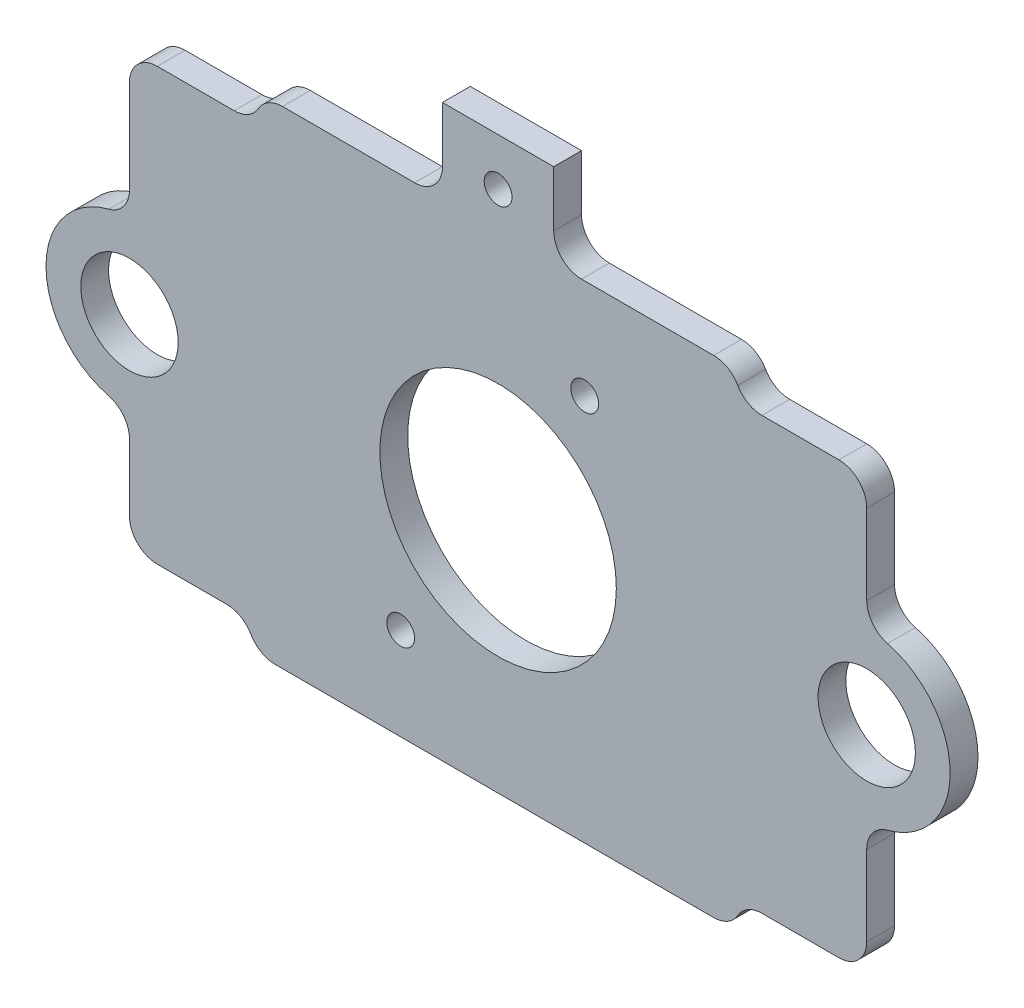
ISO-10303-21;
HEADER;
FILE_DESCRIPTION(('STEP AP214'),'2;1');
FILE_NAME('part.step','',(''),(''),'','','');
FILE_SCHEMA(('AUTOMOTIVE_DESIGN { 1 0 10303 214 1 1 1 1 }'));
ENDSEC;
DATA;
#1=APPLICATION_CONTEXT('core data for automotive mechanical design processes');
#2=APPLICATION_PROTOCOL_DEFINITION('international standard','automotive_design',2000,#1);
#3=PRODUCT_CONTEXT('',#1,'mechanical');
#4=PRODUCT('Part','Part','',(#3));
#5=PRODUCT_RELATED_PRODUCT_CATEGORY('part','',(#4));
#6=PRODUCT_DEFINITION_FORMATION('','',#4);
#7=PRODUCT_DEFINITION_CONTEXT('part definition',#1,'design');
#8=PRODUCT_DEFINITION('design','',#6,#7);
#9=PRODUCT_DEFINITION_SHAPE('','',#8);
#10=(LENGTH_UNIT() NAMED_UNIT(*) SI_UNIT(.MILLI.,.METRE.));
#11=(NAMED_UNIT(*) PLANE_ANGLE_UNIT() SI_UNIT($,.RADIAN.));
#12=(NAMED_UNIT(*) SI_UNIT($,.STERADIAN.) SOLID_ANGLE_UNIT());
#13=UNCERTAINTY_MEASURE_WITH_UNIT(LENGTH_MEASURE(1.E-05),#10,'distance_accuracy_value','');
#14=(GEOMETRIC_REPRESENTATION_CONTEXT(3) GLOBAL_UNCERTAINTY_ASSIGNED_CONTEXT((#13)) GLOBAL_UNIT_ASSIGNED_CONTEXT((#10,
#11,#12)) REPRESENTATION_CONTEXT('',''));
#15=CARTESIAN_POINT('',(0.,0.,0.));
#16=DIRECTION('',(0.,0.,1.));
#17=DIRECTION('',(1.,0.,0.));
#18=AXIS2_PLACEMENT_3D('',#15,#16,#17);
#19=CARTESIAN_POINT('',(26.5,0.49999999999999,2.));
#20=DIRECTION('',(0.,0.,1.));
#21=DIRECTION('',(1.,0.,0.));
#22=AXIS2_PLACEMENT_3D('',#19,#20,#21);
#23=PLANE('',#22);
#24=CARTESIAN_POINT('',(6.225915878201,10.8391868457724,2.));
#25=DIRECTION('',(0.,0.,1.));
#26=DIRECTION('',(1.,0.,0.));
#27=AXIS2_PLACEMENT_3D('',#24,#25,#26);
#28=CIRCLE('',#27,1.);
#29=CARTESIAN_POINT('',(7.225915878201,10.8391868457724,2.));
#30=VERTEX_POINT('',#29);
#31=EDGE_CURVE('E604',#30,#30,#28,.T.);
#32=ORIENTED_EDGE('',*,*,#31,.F.);
#33=EDGE_LOOP('',(#32));
#34=FACE_BOUND('',#33,.T.);
#35=CARTESIAN_POINT('',(26.5,0.49999999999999,2.));
#36=DIRECTION('',(0.,0.,1.));
#37=DIRECTION('',(1.,0.,0.));
#38=AXIS2_PLACEMENT_3D('',#35,#36,#37);
#39=CIRCLE('',#38,3.5);
#40=CARTESIAN_POINT('',(30.,0.49999999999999,2.));
#41=VERTEX_POINT('',#40);
#42=EDGE_CURVE('E592',#41,#41,#39,.T.);
#43=ORIENTED_EDGE('',*,*,#42,.F.);
#44=EDGE_LOOP('',(#43));
#45=FACE_BOUND('',#44,.T.);
#46=CARTESIAN_POINT('',(0.,0.,2.));
#47=DIRECTION('',(0.,0.,1.));
#48=DIRECTION('',(1.,0.,0.));
#49=AXIS2_PLACEMENT_3D('',#46,#47,#48);
#50=CIRCLE('',#49,8.5);
#51=CARTESIAN_POINT('',(8.5,0.,2.));
#52=VERTEX_POINT('',#51);
#53=EDGE_CURVE('E578',#52,#52,#50,.T.);
#54=ORIENTED_EDGE('',*,*,#53,.F.);
#55=EDGE_LOOP('',(#54));
#56=FACE_BOUND('',#55,.T.);
#57=DIRECTION('',(1.,0.,0.));
#58=VECTOR('',#57,1.);
#59=CARTESIAN_POINT('',(-17.5000000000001,-17.,2.));
#60=LINE('',#59,#58);
#61=CARTESIAN_POINT('',(-16.0358983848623,-17.,2.));
#62=VERTEX_POINT('',#61);
#63=CARTESIAN_POINT('',(15.5,-17.,2.));
#64=VERTEX_POINT('',#63);
#65=EDGE_CURVE('E336',#62,#64,#60,.T.);
#66=ORIENTED_EDGE('',*,*,#65,.T.);
#67=CARTESIAN_POINT('',(15.5,-15.,2.));
#68=DIRECTION('',(0.,0.,1.));
#69=DIRECTION('',(1.,0.,0.));
#70=AXIS2_PLACEMENT_3D('',#67,#68,#69);
#71=CIRCLE('',#70,2.);
#72=CARTESIAN_POINT('',(17.2320508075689,-16.,2.));
#73=VERTEX_POINT('',#72);
#74=EDGE_CURVE('E481',#64,#73,#71,.T.);
#75=ORIENTED_EDGE('',*,*,#74,.T.);
#76=CARTESIAN_POINT('',(18.9641016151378,-17.,2.));
#77=DIRECTION('',(0.,0.,1.));
#78=DIRECTION('',(1.,0.,0.));
#79=AXIS2_PLACEMENT_3D('',#76,#77,#78);
#80=CIRCLE('',#79,2.);
#81=CARTESIAN_POINT('',(18.9641016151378,-15.,2.));
#82=VERTEX_POINT('',#81);
#83=EDGE_CURVE('E11',#73,#82,#80,.F.);
#84=ORIENTED_EDGE('',*,*,#83,.T.);
#85=DIRECTION('',(-1.,0.,0.));
#86=VECTOR('',#85,1.);
#87=CARTESIAN_POINT('',(26.5,-15.,2.));
#88=LINE('',#87,#86);
#89=CARTESIAN_POINT('',(24.5,-15.,2.));
#90=VERTEX_POINT('',#89);
#91=EDGE_CURVE('E333',#90,#82,#88,.T.);
#92=ORIENTED_EDGE('',*,*,#91,.F.);
#93=CARTESIAN_POINT('',(24.5,-13.,2.));
#94=DIRECTION('',(0.,0.,1.));
#95=DIRECTION('',(1.,0.,0.));
#96=AXIS2_PLACEMENT_3D('',#93,#94,#95);
#97=CIRCLE('',#96,2.);
#98=CARTESIAN_POINT('',(26.5,-13.,2.));
#99=VERTEX_POINT('',#98);
#100=EDGE_CURVE('E479',#90,#99,#97,.T.);
#101=ORIENTED_EDGE('',*,*,#100,.T.);
#102=DIRECTION('',(0.,-1.,0.));
#103=VECTOR('',#102,1.);
#104=CARTESIAN_POINT('',(26.5,-5.50000000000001,2.));
#105=LINE('',#104,#103);
#106=CARTESIAN_POINT('',(26.5,-7.24596669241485,2.));
#107=VERTEX_POINT('',#106);
#108=EDGE_CURVE('E330',#107,#99,#105,.T.);
#109=ORIENTED_EDGE('',*,*,#108,.F.);
#110=CARTESIAN_POINT('',(28.5,-7.24596669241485,2.));
#111=DIRECTION('',(0.,0.,1.));
#112=DIRECTION('',(1.,0.,0.));
#113=AXIS2_PLACEMENT_3D('',#110,#111,#112);
#114=CIRCLE('',#113,2.);
#115=CARTESIAN_POINT('',(28.,-5.30947501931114,2.));
#116=VERTEX_POINT('',#115);
#117=EDGE_CURVE('E495',#107,#116,#114,.F.);
#118=ORIENTED_EDGE('',*,*,#117,.T.);
#119=CARTESIAN_POINT('',(26.5,0.49999999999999,2.));
#120=DIRECTION('',(0.,0.,1.));
#121=DIRECTION('',(1.,0.,0.));
#122=AXIS2_PLACEMENT_3D('',#119,#120,#121);
#123=CIRCLE('',#122,6.);
#124=CARTESIAN_POINT('',(28.,6.30947501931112,2.));
#125=VERTEX_POINT('',#124);
#126=EDGE_CURVE('E328',#116,#125,#123,.T.);
#127=ORIENTED_EDGE('',*,*,#126,.T.);
#128=CARTESIAN_POINT('',(28.5,8.24596669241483,2.));
#129=DIRECTION('',(0.,0.,1.));
#130=DIRECTION('',(1.,0.,0.));
#131=AXIS2_PLACEMENT_3D('',#128,#129,#130);
#132=CIRCLE('',#131,2.);
#133=CARTESIAN_POINT('',(26.5,8.24596669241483,2.));
#134=VERTEX_POINT('',#133);
#135=EDGE_CURVE('E386',#125,#134,#132,.F.);
#136=ORIENTED_EDGE('',*,*,#135,.T.);
#137=DIRECTION('',(0.,-1.,0.));
#138=VECTOR('',#137,1.);
#139=CARTESIAN_POINT('',(26.5,16.,2.));
#140=LINE('',#139,#138);
#141=CARTESIAN_POINT('',(26.5,14.,2.));
#142=VERTEX_POINT('',#141);
#143=EDGE_CURVE('E325',#142,#134,#140,.T.);
#144=ORIENTED_EDGE('',*,*,#143,.F.);
#145=CARTESIAN_POINT('',(24.5,14.,2.));
#146=DIRECTION('',(0.,0.,1.));
#147=DIRECTION('',(1.,0.,0.));
#148=AXIS2_PLACEMENT_3D('',#145,#146,#147);
#149=CIRCLE('',#148,2.);
#150=CARTESIAN_POINT('',(24.5,16.,2.));
#151=VERTEX_POINT('',#150);
#152=EDGE_CURVE('E364',#142,#151,#149,.T.);
#153=ORIENTED_EDGE('',*,*,#152,.T.);
#154=DIRECTION('',(-1.,0.,0.));
#155=VECTOR('',#154,1.);
#156=CARTESIAN_POINT('',(26.5,16.,2.));
#157=LINE('',#156,#155);
#158=CARTESIAN_POINT('',(18.9641016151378,16.,2.));
#159=VERTEX_POINT('',#158);
#160=EDGE_CURVE('E322',#151,#159,#157,.T.);
#161=ORIENTED_EDGE('',*,*,#160,.T.);
#162=CARTESIAN_POINT('',(18.9641016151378,18.,2.));
#163=DIRECTION('',(0.,0.,1.));
#164=DIRECTION('',(1.,0.,0.));
#165=AXIS2_PLACEMENT_3D('',#162,#163,#164);
#166=CIRCLE('',#165,2.);
#167=CARTESIAN_POINT('',(17.232050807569,17.,2.));
#168=VERTEX_POINT('',#167);
#169=EDGE_CURVE('E395',#159,#168,#166,.F.);
#170=ORIENTED_EDGE('',*,*,#169,.T.);
#171=CARTESIAN_POINT('',(15.5000000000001,16.0000000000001,2.));
#172=DIRECTION('',(0.,0.,1.));
#173=DIRECTION('',(1.,0.,0.));
#174=AXIS2_PLACEMENT_3D('',#171,#172,#173);
#175=CIRCLE('',#174,2.);
#176=CARTESIAN_POINT('',(15.5000000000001,18.0000000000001,2.));
#177=VERTEX_POINT('',#176);
#178=EDGE_CURVE('E366',#168,#177,#175,.T.);
#179=ORIENTED_EDGE('',*,*,#178,.T.);
#180=DIRECTION('',(1.,0.,0.));
#181=VECTOR('',#180,1.);
#182=CARTESIAN_POINT('',(4.,18.,2.));
#183=LINE('',#182,#181);
#184=CARTESIAN_POINT('',(6.00000000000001,18.,2.));
#185=VERTEX_POINT('',#184);
#186=EDGE_CURVE('E319',#185,#177,#183,.T.);
#187=ORIENTED_EDGE('',*,*,#186,.F.);
#188=CARTESIAN_POINT('',(6.,20.,2.));
#189=DIRECTION('',(0.,0.,1.));
#190=DIRECTION('',(1.,0.,0.));
#191=AXIS2_PLACEMENT_3D('',#188,#189,#190);
#192=CIRCLE('',#191,2.);
#193=CARTESIAN_POINT('',(4.,20.,2.));
#194=VERTEX_POINT('',#193);
#195=EDGE_CURVE('E381',#185,#194,#192,.F.);
#196=ORIENTED_EDGE('',*,*,#195,.T.);
#197=DIRECTION('',(0.,-1.,0.));
#198=VECTOR('',#197,1.);
#199=CARTESIAN_POINT('',(4.,24.,2.));
#200=LINE('',#199,#198);
#201=CARTESIAN_POINT('',(4.,24.,2.));
#202=VERTEX_POINT('',#201);
#203=EDGE_CURVE('E316',#202,#194,#200,.T.);
#204=ORIENTED_EDGE('',*,*,#203,.F.);
#205=DIRECTION('',(1.,0.,0.));
#206=VECTOR('',#205,1.);
#207=CARTESIAN_POINT('',(-4.,24.,2.));
#208=LINE('',#207,#206);
#209=CARTESIAN_POINT('',(-4.,24.,2.));
#210=VERTEX_POINT('',#209);
#211=EDGE_CURVE('E314',#210,#202,#208,.T.);
#212=ORIENTED_EDGE('',*,*,#211,.F.);
#213=DIRECTION('',(0.,1.,0.));
#214=VECTOR('',#213,1.);
#215=CARTESIAN_POINT('',(-4.,18.,2.));
#216=LINE('',#215,#214);
#217=CARTESIAN_POINT('',(-4.,20.,2.));
#218=VERTEX_POINT('',#217);
#219=EDGE_CURVE('E263',#218,#210,#216,.T.);
#220=ORIENTED_EDGE('',*,*,#219,.F.);
#221=CARTESIAN_POINT('',(-6.,20.,2.));
#222=DIRECTION('',(0.,0.,1.));
#223=DIRECTION('',(1.,0.,0.));
#224=AXIS2_PLACEMENT_3D('',#221,#222,#223);
#225=CIRCLE('',#224,2.);
#226=CARTESIAN_POINT('',(-6.,18.,2.));
#227=VERTEX_POINT('',#226);
#228=EDGE_CURVE('E419',#218,#227,#225,.F.);
#229=ORIENTED_EDGE('',*,*,#228,.T.);
#230=DIRECTION('',(1.,0.,0.));
#231=VECTOR('',#230,1.);
#232=CARTESIAN_POINT('',(-17.5000000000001,18.,2.));
#233=LINE('',#232,#231);
#234=CARTESIAN_POINT('',(-15.5000000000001,18.,2.));
#235=VERTEX_POINT('',#234);
#236=EDGE_CURVE('E310',#235,#227,#233,.T.);
#237=ORIENTED_EDGE('',*,*,#236,.F.);
#238=CARTESIAN_POINT('',(-15.5000000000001,16.,2.));
#239=DIRECTION('',(0.,0.,1.));
#240=DIRECTION('',(1.,0.,0.));
#241=AXIS2_PLACEMENT_3D('',#238,#239,#240);
#242=CIRCLE('',#241,2.);
#243=CARTESIAN_POINT('',(-17.2320508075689,17.,2.));
#244=VERTEX_POINT('',#243);
#245=EDGE_CURVE('E410',#235,#244,#242,.T.);
#246=ORIENTED_EDGE('',*,*,#245,.T.);
#247=CARTESIAN_POINT('',(-18.9641016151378,18.,2.));
#248=DIRECTION('',(0.,0.,1.));
#249=DIRECTION('',(1.,0.,0.));
#250=AXIS2_PLACEMENT_3D('',#247,#248,#249);
#251=CIRCLE('',#250,2.);
#252=CARTESIAN_POINT('',(-18.9641016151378,16.,2.));
#253=VERTEX_POINT('',#252);
#254=EDGE_CURVE('E428',#244,#253,#251,.F.);
#255=ORIENTED_EDGE('',*,*,#254,.T.);
#256=DIRECTION('',(1.,0.,0.));
#257=VECTOR('',#256,1.);
#258=CARTESIAN_POINT('',(-26.5,16.,2.));
#259=LINE('',#258,#257);
#260=CARTESIAN_POINT('',(-24.5,16.,2.));
#261=VERTEX_POINT('',#260);
#262=EDGE_CURVE('E307',#261,#253,#259,.T.);
#263=ORIENTED_EDGE('',*,*,#262,.F.);
#264=CARTESIAN_POINT('',(-24.5,14.,2.));
#265=DIRECTION('',(0.,0.,1.));
#266=DIRECTION('',(1.,0.,0.));
#267=AXIS2_PLACEMENT_3D('',#264,#265,#266);
#268=CIRCLE('',#267,2.);
#269=CARTESIAN_POINT('',(-26.5,14.,2.));
#270=VERTEX_POINT('',#269);
#271=EDGE_CURVE('E408',#261,#270,#268,.T.);
#272=ORIENTED_EDGE('',*,*,#271,.T.);
#273=DIRECTION('',(0.,-1.,0.));
#274=VECTOR('',#273,1.);
#275=CARTESIAN_POINT('',(-26.5,16.,2.));
#276=LINE('',#275,#274);
#277=CARTESIAN_POINT('',(-26.5,7.29596669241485,2.));
#278=VERTEX_POINT('',#277);
#279=EDGE_CURVE('E268',#270,#278,#276,.T.);
#280=ORIENTED_EDGE('',*,*,#279,.T.);
#281=CARTESIAN_POINT('',(-28.5,7.29596669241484,2.));
#282=DIRECTION('',(0.,0.,1.));
#283=DIRECTION('',(1.,0.,0.));
#284=AXIS2_PLACEMENT_3D('',#281,#282,#283);
#285=CIRCLE('',#284,2.);
#286=CARTESIAN_POINT('',(-28.,5.35947501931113,2.));
#287=VERTEX_POINT('',#286);
#288=EDGE_CURVE('E437',#278,#287,#285,.F.);
#289=ORIENTED_EDGE('',*,*,#288,.T.);
#290=CARTESIAN_POINT('',(-26.5,-0.449999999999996,2.));
#291=DIRECTION('',(0.,0.,1.));
#292=DIRECTION('',(1.,0.,0.));
#293=AXIS2_PLACEMENT_3D('',#290,#291,#292);
#294=CIRCLE('',#293,6.);
#295=CARTESIAN_POINT('',(-28.,-6.25947501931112,2.));
#296=VERTEX_POINT('',#295);
#297=EDGE_CURVE('E345',#287,#296,#294,.T.);
#298=ORIENTED_EDGE('',*,*,#297,.T.);
#299=CARTESIAN_POINT('',(-28.5,-8.19596669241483,2.));
#300=DIRECTION('',(0.,0.,1.));
#301=DIRECTION('',(1.,0.,0.));
#302=AXIS2_PLACEMENT_3D('',#299,#300,#301);
#303=CIRCLE('',#302,2.);
#304=CARTESIAN_POINT('',(-26.5,-8.19596669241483,2.));
#305=VERTEX_POINT('',#304);
#306=EDGE_CURVE('E462',#296,#305,#303,.F.);
#307=ORIENTED_EDGE('',*,*,#306,.T.);
#308=DIRECTION('',(0.,-1.,0.));
#309=VECTOR('',#308,1.);
#310=CARTESIAN_POINT('',(-26.5,-6.44999999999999,2.));
#311=LINE('',#310,#309);
#312=CARTESIAN_POINT('',(-26.5,-13.,2.));
#313=VERTEX_POINT('',#312);
#314=EDGE_CURVE('E342',#305,#313,#311,.T.);
#315=ORIENTED_EDGE('',*,*,#314,.T.);
#316=CARTESIAN_POINT('',(-24.5,-13.,2.));
#317=DIRECTION('',(0.,0.,1.));
#318=DIRECTION('',(1.,0.,0.));
#319=AXIS2_PLACEMENT_3D('',#316,#317,#318);
#320=CIRCLE('',#319,2.);
#321=CARTESIAN_POINT('',(-24.5,-15.,2.));
#322=VERTEX_POINT('',#321);
#323=EDGE_CURVE('E451',#313,#322,#320,.T.);
#324=ORIENTED_EDGE('',*,*,#323,.T.);
#325=DIRECTION('',(1.,0.,0.));
#326=VECTOR('',#325,1.);
#327=CARTESIAN_POINT('',(-26.5,-15.,2.));
#328=LINE('',#327,#326);
#329=CARTESIAN_POINT('',(-19.5000000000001,-15.,2.));
#330=VERTEX_POINT('',#329);
#331=EDGE_CURVE('E339',#322,#330,#328,.T.);
#332=ORIENTED_EDGE('',*,*,#331,.T.);
#333=CARTESIAN_POINT('',(-19.5000000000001,-17.,2.));
#334=DIRECTION('',(0.,0.,1.));
#335=DIRECTION('',(1.,0.,0.));
#336=AXIS2_PLACEMENT_3D('',#333,#334,#335);
#337=CIRCLE('',#336,2.);
#338=CARTESIAN_POINT('',(-17.7679491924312,-16.,2.));
#339=VERTEX_POINT('',#338);
#340=EDGE_CURVE('E457',#330,#339,#337,.F.);
#341=ORIENTED_EDGE('',*,*,#340,.T.);
#342=CARTESIAN_POINT('',(-16.0358983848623,-15.,2.));
#343=DIRECTION('',(0.,0.,1.));
#344=DIRECTION('',(1.,0.,0.));
#345=AXIS2_PLACEMENT_3D('',#342,#343,#344);
#346=CIRCLE('',#345,2.);
#347=EDGE_CURVE('E471',#339,#62,#346,.T.);
#348=ORIENTED_EDGE('',*,*,#347,.T.);
#349=EDGE_LOOP('',(#66,#75,#84,#92,#101,#109,#118,#127,#136,#144,#153,#161,#170,#179,#187,#196,
#204,#212,#220,#229,#237,#246,#255,#263,#272,#280,#289,#298,#307,#315,#324,#332,#341,#348));
#350=FACE_BOUND('',#349,.T.);
#351=CARTESIAN_POINT('',(-26.5,-0.449999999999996,2.));
#352=DIRECTION('',(0.,0.,1.));
#353=DIRECTION('',(1.,0.,0.));
#354=AXIS2_PLACEMENT_3D('',#351,#352,#353);
#355=CIRCLE('',#354,3.5);
#356=CARTESIAN_POINT('',(-23.,-0.449999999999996,2.));
#357=VERTEX_POINT('',#356);
#358=EDGE_CURVE('E586',#357,#357,#355,.T.);
#359=ORIENTED_EDGE('',*,*,#358,.F.);
#360=EDGE_LOOP('',(#359));
#361=FACE_BOUND('',#360,.T.);
#362=CARTESIAN_POINT('',(0.,20.6,2.));
#363=DIRECTION('',(0.,0.,1.));
#364=DIRECTION('',(1.,0.,0.));
#365=AXIS2_PLACEMENT_3D('',#362,#363,#364);
#366=CIRCLE('',#365,1.);
#367=CARTESIAN_POINT('',(1.,20.6,2.));
#368=VERTEX_POINT('',#367);
#369=EDGE_CURVE('E598',#368,#368,#366,.T.);
#370=ORIENTED_EDGE('',*,*,#369,.F.);
#371=EDGE_LOOP('',(#370));
#372=FACE_BOUND('',#371,.T.);
#373=CARTESIAN_POINT('',(-7.00129093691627,-10.3552848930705,2.));
#374=DIRECTION('',(0.,0.,1.));
#375=DIRECTION('',(1.,0.,0.));
#376=AXIS2_PLACEMENT_3D('',#373,#374,#375);
#377=CIRCLE('',#376,1.);
#378=CARTESIAN_POINT('',(-6.00129093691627,-10.3552848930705,2.));
#379=VERTEX_POINT('',#378);
#380=EDGE_CURVE('E610',#379,#379,#377,.T.);
#381=ORIENTED_EDGE('',*,*,#380,.F.);
#382=EDGE_LOOP('',(#381));
#383=FACE_BOUND('',#382,.T.);
#384=ADVANCED_FACE('F26',(#34,#45,#56,#350,#361,#372,#383),#23,.T.);
#385=CARTESIAN_POINT('',(26.5,0.49999999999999,0.));
#386=DIRECTION('',(0.,0.,1.));
#387=DIRECTION('',(1.,0.,0.));
#388=AXIS2_PLACEMENT_3D('',#385,#386,#387);
#389=PLANE('',#388);
#390=CARTESIAN_POINT('',(6.225915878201,10.8391868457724,0.));
#391=DIRECTION('',(0.,0.,1.));
#392=DIRECTION('',(1.,0.,0.));
#393=AXIS2_PLACEMENT_3D('',#390,#391,#392);
#394=CIRCLE('',#393,1.);
#395=CARTESIAN_POINT('',(7.225915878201,10.8391868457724,0.));
#396=VERTEX_POINT('',#395);
#397=EDGE_CURVE('E607',#396,#396,#394,.T.);
#398=ORIENTED_EDGE('',*,*,#397,.T.);
#399=EDGE_LOOP('',(#398));
#400=FACE_BOUND('',#399,.T.);
#401=CARTESIAN_POINT('',(26.5,0.49999999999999,0.));
#402=DIRECTION('',(0.,0.,1.));
#403=DIRECTION('',(1.,0.,0.));
#404=AXIS2_PLACEMENT_3D('',#401,#402,#403);
#405=CIRCLE('',#404,3.5);
#406=CARTESIAN_POINT('',(30.,0.49999999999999,0.));
#407=VERTEX_POINT('',#406);
#408=EDGE_CURVE('E595',#407,#407,#405,.T.);
#409=ORIENTED_EDGE('',*,*,#408,.T.);
#410=EDGE_LOOP('',(#409));
#411=FACE_BOUND('',#410,.T.);
#412=CARTESIAN_POINT('',(0.,0.,0.));
#413=DIRECTION('',(0.,0.,1.));
#414=DIRECTION('',(1.,0.,0.));
#415=AXIS2_PLACEMENT_3D('',#412,#413,#414);
#416=CIRCLE('',#415,8.5);
#417=CARTESIAN_POINT('',(8.5,0.,0.));
#418=VERTEX_POINT('',#417);
#419=EDGE_CURVE('E583',#418,#418,#416,.T.);
#420=ORIENTED_EDGE('',*,*,#419,.T.);
#421=EDGE_LOOP('',(#420));
#422=FACE_BOUND('',#421,.T.);
#423=DIRECTION('',(-1.,0.,0.));
#424=VECTOR('',#423,1.);
#425=CARTESIAN_POINT('',(26.5,-15.,0.));
#426=LINE('',#425,#424);
#427=CARTESIAN_POINT('',(24.5,-15.,0.));
#428=VERTEX_POINT('',#427);
#429=CARTESIAN_POINT('',(18.9641016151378,-15.,0.));
#430=VERTEX_POINT('',#429);
#431=EDGE_CURVE('E290',#428,#430,#426,.T.);
#432=ORIENTED_EDGE('',*,*,#431,.T.);
#433=CARTESIAN_POINT('',(18.9641016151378,-17.,0.));
#434=DIRECTION('',(0.,0.,1.));
#435=DIRECTION('',(1.,0.,0.));
#436=AXIS2_PLACEMENT_3D('',#433,#434,#435);
#437=CIRCLE('',#436,2.);
#438=CARTESIAN_POINT('',(17.2320508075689,-16.,0.));
#439=VERTEX_POINT('',#438);
#440=EDGE_CURVE('E34',#430,#439,#437,.T.);
#441=ORIENTED_EDGE('',*,*,#440,.T.);
#442=CARTESIAN_POINT('',(15.5,-15.,0.));
#443=DIRECTION('',(0.,0.,1.));
#444=DIRECTION('',(1.,0.,0.));
#445=AXIS2_PLACEMENT_3D('',#442,#443,#444);
#446=CIRCLE('',#445,2.);
#447=CARTESIAN_POINT('',(15.5,-17.,0.));
#448=VERTEX_POINT('',#447);
#449=EDGE_CURVE('E475',#439,#448,#446,.F.);
#450=ORIENTED_EDGE('',*,*,#449,.T.);
#451=DIRECTION('',(1.,0.,0.));
#452=VECTOR('',#451,1.);
#453=CARTESIAN_POINT('',(-17.5000000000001,-17.,0.));
#454=LINE('',#453,#452);
#455=CARTESIAN_POINT('',(-16.0358983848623,-17.,0.));
#456=VERTEX_POINT('',#455);
#457=EDGE_CURVE('E292',#456,#448,#454,.T.);
#458=ORIENTED_EDGE('',*,*,#457,.F.);
#459=CARTESIAN_POINT('',(-16.0358983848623,-15.,0.));
#460=DIRECTION('',(0.,0.,1.));
#461=DIRECTION('',(1.,0.,0.));
#462=AXIS2_PLACEMENT_3D('',#459,#460,#461);
#463=CIRCLE('',#462,2.);
#464=CARTESIAN_POINT('',(-17.7679491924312,-16.,0.));
#465=VERTEX_POINT('',#464);
#466=EDGE_CURVE('E467',#456,#465,#463,.F.);
#467=ORIENTED_EDGE('',*,*,#466,.T.);
#468=CARTESIAN_POINT('',(-19.5000000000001,-17.,0.));
#469=DIRECTION('',(0.,0.,1.));
#470=DIRECTION('',(1.,0.,0.));
#471=AXIS2_PLACEMENT_3D('',#468,#469,#470);
#472=CIRCLE('',#471,2.);
#473=CARTESIAN_POINT('',(-19.5000000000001,-15.,0.));
#474=VERTEX_POINT('',#473);
#475=EDGE_CURVE('E455',#465,#474,#472,.T.);
#476=ORIENTED_EDGE('',*,*,#475,.T.);
#477=DIRECTION('',(1.,0.,0.));
#478=VECTOR('',#477,1.);
#479=CARTESIAN_POINT('',(-26.5,-15.,0.));
#480=LINE('',#479,#478);
#481=CARTESIAN_POINT('',(-24.5,-15.,0.));
#482=VERTEX_POINT('',#481);
#483=EDGE_CURVE('E295',#482,#474,#480,.T.);
#484=ORIENTED_EDGE('',*,*,#483,.F.);
#485=CARTESIAN_POINT('',(-24.5,-13.,0.));
#486=DIRECTION('',(0.,0.,1.));
#487=DIRECTION('',(1.,0.,0.));
#488=AXIS2_PLACEMENT_3D('',#485,#486,#487);
#489=CIRCLE('',#488,2.);
#490=CARTESIAN_POINT('',(-26.5,-13.,0.));
#491=VERTEX_POINT('',#490);
#492=EDGE_CURVE('E444',#482,#491,#489,.F.);
#493=ORIENTED_EDGE('',*,*,#492,.T.);
#494=DIRECTION('',(0.,-1.,0.));
#495=VECTOR('',#494,1.);
#496=CARTESIAN_POINT('',(-26.5,-6.44999999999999,0.));
#497=LINE('',#496,#495);
#498=CARTESIAN_POINT('',(-26.5,-8.19596669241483,0.));
#499=VERTEX_POINT('',#498);
#500=EDGE_CURVE('E298',#499,#491,#497,.T.);
#501=ORIENTED_EDGE('',*,*,#500,.F.);
#502=CARTESIAN_POINT('',(-28.5,-8.19596669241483,0.));
#503=DIRECTION('',(0.,0.,1.));
#504=DIRECTION('',(1.,0.,0.));
#505=AXIS2_PLACEMENT_3D('',#502,#503,#504);
#506=CIRCLE('',#505,2.);
#507=CARTESIAN_POINT('',(-28.,-6.25947501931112,0.));
#508=VERTEX_POINT('',#507);
#509=EDGE_CURVE('E460',#499,#508,#506,.T.);
#510=ORIENTED_EDGE('',*,*,#509,.T.);
#511=CARTESIAN_POINT('',(-26.5,-0.449999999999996,0.));
#512=DIRECTION('',(0.,0.,1.));
#513=DIRECTION('',(1.,0.,0.));
#514=AXIS2_PLACEMENT_3D('',#511,#512,#513);
#515=CIRCLE('',#514,6.);
#516=CARTESIAN_POINT('',(-28.,5.35947501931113,0.));
#517=VERTEX_POINT('',#516);
#518=EDGE_CURVE('E301',#517,#508,#515,.T.);
#519=ORIENTED_EDGE('',*,*,#518,.F.);
#520=CARTESIAN_POINT('',(-28.5,7.29596669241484,0.));
#521=DIRECTION('',(0.,0.,1.));
#522=DIRECTION('',(1.,0.,0.));
#523=AXIS2_PLACEMENT_3D('',#520,#521,#522);
#524=CIRCLE('',#523,2.);
#525=CARTESIAN_POINT('',(-26.5,7.29596669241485,0.));
#526=VERTEX_POINT('',#525);
#527=EDGE_CURVE('E435',#517,#526,#524,.T.);
#528=ORIENTED_EDGE('',*,*,#527,.T.);
#529=DIRECTION('',(0.,-1.,0.));
#530=VECTOR('',#529,1.);
#531=CARTESIAN_POINT('',(-26.5,16.,0.));
#532=LINE('',#531,#530);
#533=CARTESIAN_POINT('',(-26.5,14.,0.));
#534=VERTEX_POINT('',#533);
#535=EDGE_CURVE('E304',#534,#526,#532,.T.);
#536=ORIENTED_EDGE('',*,*,#535,.F.);
#537=CARTESIAN_POINT('',(-24.5,14.,0.));
#538=DIRECTION('',(0.,0.,1.));
#539=DIRECTION('',(1.,0.,0.));
#540=AXIS2_PLACEMENT_3D('',#537,#538,#539);
#541=CIRCLE('',#540,2.);
#542=CARTESIAN_POINT('',(-24.5,16.,0.));
#543=VERTEX_POINT('',#542);
#544=EDGE_CURVE('E404',#534,#543,#541,.F.);
#545=ORIENTED_EDGE('',*,*,#544,.T.);
#546=DIRECTION('',(1.,0.,0.));
#547=VECTOR('',#546,1.);
#548=CARTESIAN_POINT('',(-26.5,16.,0.));
#549=LINE('',#548,#547);
#550=CARTESIAN_POINT('',(-18.9641016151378,16.,0.));
#551=VERTEX_POINT('',#550);
#552=EDGE_CURVE('E576',#543,#551,#549,.T.);
#553=ORIENTED_EDGE('',*,*,#552,.T.);
#554=CARTESIAN_POINT('',(-18.9641016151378,18.,0.));
#555=DIRECTION('',(0.,0.,1.));
#556=DIRECTION('',(1.,0.,0.));
#557=AXIS2_PLACEMENT_3D('',#554,#555,#556);
#558=CIRCLE('',#557,2.);
#559=CARTESIAN_POINT('',(-17.2320508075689,17.,0.));
#560=VERTEX_POINT('',#559);
#561=EDGE_CURVE('E426',#551,#560,#558,.T.);
#562=ORIENTED_EDGE('',*,*,#561,.T.);
#563=CARTESIAN_POINT('',(-15.5000000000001,16.,0.));
#564=DIRECTION('',(0.,0.,1.));
#565=DIRECTION('',(1.,0.,0.));
#566=AXIS2_PLACEMENT_3D('',#563,#564,#565);
#567=CIRCLE('',#566,2.);
#568=CARTESIAN_POINT('',(-15.5000000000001,18.,0.));
#569=VERTEX_POINT('',#568);
#570=EDGE_CURVE('E406',#560,#569,#567,.F.);
#571=ORIENTED_EDGE('',*,*,#570,.T.);
#572=DIRECTION('',(1.,0.,0.));
#573=VECTOR('',#572,1.);
#574=CARTESIAN_POINT('',(-17.5000000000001,18.,0.));
#575=LINE('',#574,#573);
#576=CARTESIAN_POINT('',(-6.,18.,0.));
#577=VERTEX_POINT('',#576);
#578=EDGE_CURVE('E257',#569,#577,#575,.T.);
#579=ORIENTED_EDGE('',*,*,#578,.T.);
#580=CARTESIAN_POINT('',(-6.,20.,0.));
#581=DIRECTION('',(0.,0.,1.));
#582=DIRECTION('',(1.,0.,0.));
#583=AXIS2_PLACEMENT_3D('',#580,#581,#582);
#584=CIRCLE('',#583,2.);
#585=CARTESIAN_POINT('',(-4.,20.,0.));
#586=VERTEX_POINT('',#585);
#587=EDGE_CURVE('E254',#577,#586,#584,.T.);
#588=ORIENTED_EDGE('',*,*,#587,.T.);
#589=DIRECTION('',(0.,1.,0.));
#590=VECTOR('',#589,1.);
#591=CARTESIAN_POINT('',(-4.,18.,0.));
#592=LINE('',#591,#590);
#593=CARTESIAN_POINT('',(-4.,24.,0.));
#594=VERTEX_POINT('',#593);
#595=EDGE_CURVE('E245',#586,#594,#592,.T.);
#596=ORIENTED_EDGE('',*,*,#595,.T.);
#597=DIRECTION('',(1.,0.,0.));
#598=VECTOR('',#597,1.);
#599=CARTESIAN_POINT('',(-4.,24.,0.));
#600=LINE('',#599,#598);
#601=CARTESIAN_POINT('',(4.,24.,0.));
#602=VERTEX_POINT('',#601);
#603=EDGE_CURVE('E251',#594,#602,#600,.T.);
#604=ORIENTED_EDGE('',*,*,#603,.T.);
#605=DIRECTION('',(0.,-1.,0.));
#606=VECTOR('',#605,1.);
#607=CARTESIAN_POINT('',(4.,24.,0.));
#608=LINE('',#607,#606);
#609=CARTESIAN_POINT('',(4.,20.,0.));
#610=VERTEX_POINT('',#609);
#611=EDGE_CURVE('E271',#602,#610,#608,.T.);
#612=ORIENTED_EDGE('',*,*,#611,.T.);
#613=CARTESIAN_POINT('',(6.,20.,0.));
#614=DIRECTION('',(0.,0.,1.));
#615=DIRECTION('',(1.,0.,0.));
#616=AXIS2_PLACEMENT_3D('',#613,#614,#615);
#617=CIRCLE('',#616,2.);
#618=CARTESIAN_POINT('',(6.00000000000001,18.,0.));
#619=VERTEX_POINT('',#618);
#620=EDGE_CURVE('E379',#610,#619,#617,.T.);
#621=ORIENTED_EDGE('',*,*,#620,.T.);
#622=DIRECTION('',(1.,0.,0.));
#623=VECTOR('',#622,1.);
#624=CARTESIAN_POINT('',(4.,18.,0.));
#625=LINE('',#624,#623);
#626=CARTESIAN_POINT('',(15.5000000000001,18.0000000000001,0.));
#627=VERTEX_POINT('',#626);
#628=EDGE_CURVE('E273',#619,#627,#625,.T.);
#629=ORIENTED_EDGE('',*,*,#628,.T.);
#630=CARTESIAN_POINT('',(15.5000000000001,16.0000000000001,0.));
#631=DIRECTION('',(0.,0.,1.));
#632=DIRECTION('',(1.,0.,0.));
#633=AXIS2_PLACEMENT_3D('',#630,#631,#632);
#634=CIRCLE('',#633,2.);
#635=CARTESIAN_POINT('',(17.232050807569,17.,0.));
#636=VERTEX_POINT('',#635);
#637=EDGE_CURVE('E361',#627,#636,#634,.F.);
#638=ORIENTED_EDGE('',*,*,#637,.T.);
#639=CARTESIAN_POINT('',(18.9641016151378,18.,0.));
#640=DIRECTION('',(0.,0.,1.));
#641=DIRECTION('',(1.,0.,0.));
#642=AXIS2_PLACEMENT_3D('',#639,#640,#641);
#643=CIRCLE('',#642,2.);
#644=CARTESIAN_POINT('',(18.9641016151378,16.,0.));
#645=VERTEX_POINT('',#644);
#646=EDGE_CURVE('E393',#636,#645,#643,.T.);
#647=ORIENTED_EDGE('',*,*,#646,.T.);
#648=DIRECTION('',(-1.,0.,0.));
#649=VECTOR('',#648,1.);
#650=CARTESIAN_POINT('',(26.5,16.,0.));
#651=LINE('',#650,#649);
#652=CARTESIAN_POINT('',(24.5,16.,0.));
#653=VERTEX_POINT('',#652);
#654=EDGE_CURVE('E279',#653,#645,#651,.T.);
#655=ORIENTED_EDGE('',*,*,#654,.F.);
#656=CARTESIAN_POINT('',(24.5,14.,0.));
#657=DIRECTION('',(0.,0.,1.));
#658=DIRECTION('',(1.,0.,0.));
#659=AXIS2_PLACEMENT_3D('',#656,#657,#658);
#660=CIRCLE('',#659,2.);
#661=CARTESIAN_POINT('',(26.5,14.,0.));
#662=VERTEX_POINT('',#661);
#663=EDGE_CURVE('E359',#653,#662,#660,.F.);
#664=ORIENTED_EDGE('',*,*,#663,.T.);
#665=DIRECTION('',(0.,-1.,0.));
#666=VECTOR('',#665,1.);
#667=CARTESIAN_POINT('',(26.5,16.,0.));
#668=LINE('',#667,#666);
#669=CARTESIAN_POINT('',(26.5,8.24596669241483,0.));
#670=VERTEX_POINT('',#669);
#671=EDGE_CURVE('E282',#662,#670,#668,.T.);
#672=ORIENTED_EDGE('',*,*,#671,.T.);
#673=CARTESIAN_POINT('',(28.5,8.24596669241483,0.));
#674=DIRECTION('',(0.,0.,1.));
#675=DIRECTION('',(1.,0.,0.));
#676=AXIS2_PLACEMENT_3D('',#673,#674,#675);
#677=CIRCLE('',#676,2.);
#678=CARTESIAN_POINT('',(28.,6.30947501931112,0.));
#679=VERTEX_POINT('',#678);
#680=EDGE_CURVE('E383',#670,#679,#677,.T.);
#681=ORIENTED_EDGE('',*,*,#680,.T.);
#682=CARTESIAN_POINT('',(26.5,0.49999999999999,0.));
#683=DIRECTION('',(0.,0.,1.));
#684=DIRECTION('',(1.,0.,0.));
#685=AXIS2_PLACEMENT_3D('',#682,#683,#684);
#686=CIRCLE('',#685,6.);
#687=CARTESIAN_POINT('',(28.,-5.30947501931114,0.));
#688=VERTEX_POINT('',#687);
#689=EDGE_CURVE('E285',#688,#679,#686,.T.);
#690=ORIENTED_EDGE('',*,*,#689,.F.);
#691=CARTESIAN_POINT('',(28.5,-7.24596669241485,0.));
#692=DIRECTION('',(0.,0.,1.));
#693=DIRECTION('',(1.,0.,0.));
#694=AXIS2_PLACEMENT_3D('',#691,#692,#693);
#695=CIRCLE('',#694,2.);
#696=CARTESIAN_POINT('',(26.5,-7.24596669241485,0.));
#697=VERTEX_POINT('',#696);
#698=EDGE_CURVE('E493',#688,#697,#695,.T.);
#699=ORIENTED_EDGE('',*,*,#698,.T.);
#700=DIRECTION('',(0.,-1.,0.));
#701=VECTOR('',#700,1.);
#702=CARTESIAN_POINT('',(26.5,-5.50000000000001,0.));
#703=LINE('',#702,#701);
#704=CARTESIAN_POINT('',(26.5,-13.,0.));
#705=VERTEX_POINT('',#704);
#706=EDGE_CURVE('E287',#697,#705,#703,.T.);
#707=ORIENTED_EDGE('',*,*,#706,.T.);
#708=CARTESIAN_POINT('',(24.5,-13.,0.));
#709=DIRECTION('',(0.,0.,1.));
#710=DIRECTION('',(1.,0.,0.));
#711=AXIS2_PLACEMENT_3D('',#708,#709,#710);
#712=CIRCLE('',#711,2.);
#713=EDGE_CURVE('E473',#705,#428,#712,.F.);
#714=ORIENTED_EDGE('',*,*,#713,.T.);
#715=EDGE_LOOP('',(#432,#441,#450,#458,#467,#476,#484,#493,#501,#510,#519,#528,#536,#545,#553,
#562,#571,#579,#588,#596,#604,#612,#621,#629,#638,#647,#655,#664,#672,#681,#690,#699,#707,#714));
#716=FACE_BOUND('',#715,.T.);
#717=CARTESIAN_POINT('',(-26.5,-0.449999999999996,0.));
#718=DIRECTION('',(0.,0.,1.));
#719=DIRECTION('',(1.,0.,0.));
#720=AXIS2_PLACEMENT_3D('',#717,#718,#719);
#721=CIRCLE('',#720,3.5);
#722=CARTESIAN_POINT('',(-23.,-0.449999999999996,0.));
#723=VERTEX_POINT('',#722);
#724=EDGE_CURVE('E589',#723,#723,#721,.T.);
#725=ORIENTED_EDGE('',*,*,#724,.T.);
#726=EDGE_LOOP('',(#725));
#727=FACE_BOUND('',#726,.T.);
#728=CARTESIAN_POINT('',(0.,20.6,0.));
#729=DIRECTION('',(0.,0.,1.));
#730=DIRECTION('',(1.,0.,0.));
#731=AXIS2_PLACEMENT_3D('',#728,#729,#730);
#732=CIRCLE('',#731,1.);
#733=CARTESIAN_POINT('',(1.,20.6,0.));
#734=VERTEX_POINT('',#733);
#735=EDGE_CURVE('E601',#734,#734,#732,.T.);
#736=ORIENTED_EDGE('',*,*,#735,.T.);
#737=EDGE_LOOP('',(#736));
#738=FACE_BOUND('',#737,.T.);
#739=CARTESIAN_POINT('',(-7.00129093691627,-10.3552848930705,0.));
#740=DIRECTION('',(0.,0.,1.));
#741=DIRECTION('',(1.,0.,0.));
#742=AXIS2_PLACEMENT_3D('',#739,#740,#741);
#743=CIRCLE('',#742,1.);
#744=CARTESIAN_POINT('',(-6.00129093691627,-10.3552848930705,0.));
#745=VERTEX_POINT('',#744);
#746=EDGE_CURVE('E613',#745,#745,#743,.T.);
#747=ORIENTED_EDGE('',*,*,#746,.T.);
#748=EDGE_LOOP('',(#747));
#749=FACE_BOUND('',#748,.T.);
#750=ADVANCED_FACE('F247',(#400,#411,#422,#716,#727,#738,#749),#389,.F.);
#751=CARTESIAN_POINT('',(-26.5,16.,2.));
#752=DIRECTION('',(0.,1.,0.));
#753=DIRECTION('',(0.,0.,1.));
#754=AXIS2_PLACEMENT_3D('',#751,#752,#753);
#755=PLANE('',#754);
#756=ORIENTED_EDGE('',*,*,#262,.T.);
#757=DIRECTION('',(0.,0.,1.));
#758=VECTOR('',#757,1.);
#759=CARTESIAN_POINT('',(-18.9641016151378,16.,2.));
#760=LINE('',#759,#758);
#761=EDGE_CURVE('E421',#253,#551,#760,.F.);
#762=ORIENTED_EDGE('',*,*,#761,.T.);
#763=ORIENTED_EDGE('',*,*,#552,.F.);
#764=DIRECTION('',(0.,0.,-1.));
#765=VECTOR('',#764,1.);
#766=CARTESIAN_POINT('',(-24.5,16.,2.));
#767=LINE('',#766,#765);
#768=EDGE_CURVE('E416',#543,#261,#767,.F.);
#769=ORIENTED_EDGE('',*,*,#768,.T.);
#770=EDGE_LOOP('',(#756,#762,#763,#769));
#771=FACE_BOUND('',#770,.T.);
#772=ADVANCED_FACE('F637',(#771),#755,.T.);
#773=CARTESIAN_POINT('',(-26.5,16.,2.));
#774=DIRECTION('',(1.,0.,0.));
#775=DIRECTION('',(0.,1.,0.));
#776=AXIS2_PLACEMENT_3D('',#773,#774,#775);
#777=PLANE('',#776);
#778=ORIENTED_EDGE('',*,*,#535,.T.);
#779=DIRECTION('',(0.,0.,1.));
#780=VECTOR('',#779,1.);
#781=CARTESIAN_POINT('',(-26.5,7.29596669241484,2.));
#782=LINE('',#781,#780);
#783=EDGE_CURVE('E433',#526,#278,#782,.T.);
#784=ORIENTED_EDGE('',*,*,#783,.T.);
#785=ORIENTED_EDGE('',*,*,#279,.F.);
#786=DIRECTION('',(0.,0.,-1.));
#787=VECTOR('',#786,1.);
#788=CARTESIAN_POINT('',(-26.5,14.,2.));
#789=LINE('',#788,#787);
#790=EDGE_CURVE('E413',#270,#534,#789,.T.);
#791=ORIENTED_EDGE('',*,*,#790,.T.);
#792=EDGE_LOOP('',(#778,#784,#785,#791));
#793=FACE_BOUND('',#792,.T.);
#794=ADVANCED_FACE('F28',(#793),#777,.F.);
#795=CARTESIAN_POINT('',(-26.5,-0.449999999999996,2.));
#796=DIRECTION('',(0.,0.,-1.));
#797=DIRECTION('',(-1.,0.,0.));
#798=AXIS2_PLACEMENT_3D('',#795,#796,#797);
#799=CYLINDRICAL_SURFACE('',#798,6.);
#800=ORIENTED_EDGE('',*,*,#518,.T.);
#801=DIRECTION('',(0.,0.,-1.));
#802=VECTOR('',#801,1.);
#803=CARTESIAN_POINT('',(-28.,-6.25947501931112,2.));
#804=LINE('',#803,#802);
#805=EDGE_CURVE('E453',#508,#296,#804,.F.);
#806=ORIENTED_EDGE('',*,*,#805,.T.);
#807=ORIENTED_EDGE('',*,*,#297,.F.);
#808=DIRECTION('',(0.,0.,-1.));
#809=VECTOR('',#808,1.);
#810=CARTESIAN_POINT('',(-28.,5.35947501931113,2.));
#811=LINE('',#810,#809);
#812=EDGE_CURVE('E430',#287,#517,#811,.T.);
#813=ORIENTED_EDGE('',*,*,#812,.T.);
#814=EDGE_LOOP('',(#800,#806,#807,#813));
#815=FACE_BOUND('',#814,.T.);
#816=ADVANCED_FACE('F678',(#815),#799,.T.);
#817=CARTESIAN_POINT('',(-26.5,-6.44999999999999,2.));
#818=DIRECTION('',(1.,0.,0.));
#819=DIRECTION('',(0.,1.,0.));
#820=AXIS2_PLACEMENT_3D('',#817,#818,#819);
#821=PLANE('',#820);
#822=ORIENTED_EDGE('',*,*,#500,.T.);
#823=DIRECTION('',(0.,0.,-1.));
#824=VECTOR('',#823,1.);
#825=CARTESIAN_POINT('',(-26.5,-13.,2.));
#826=LINE('',#825,#824);
#827=EDGE_CURVE('E449',#491,#313,#826,.F.);
#828=ORIENTED_EDGE('',*,*,#827,.T.);
#829=ORIENTED_EDGE('',*,*,#314,.F.);
#830=DIRECTION('',(0.,0.,1.));
#831=VECTOR('',#830,1.);
#832=CARTESIAN_POINT('',(-26.5,-8.19596669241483,2.));
#833=LINE('',#832,#831);
#834=EDGE_CURVE('E446',#305,#499,#833,.F.);
#835=ORIENTED_EDGE('',*,*,#834,.T.);
#836=EDGE_LOOP('',(#822,#828,#829,#835));
#837=FACE_BOUND('',#836,.T.);
#838=ADVANCED_FACE('F675',(#837),#821,.F.);
#839=CARTESIAN_POINT('',(-26.5,-15.,2.));
#840=DIRECTION('',(0.,1.,0.));
#841=DIRECTION('',(-1.,0.,0.));
#842=AXIS2_PLACEMENT_3D('',#839,#840,#841);
#843=PLANE('',#842);
#844=ORIENTED_EDGE('',*,*,#483,.T.);
#845=DIRECTION('',(0.,0.,-1.));
#846=VECTOR('',#845,1.);
#847=CARTESIAN_POINT('',(-19.5000000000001,-15.,2.));
#848=LINE('',#847,#846);
#849=EDGE_CURVE('E442',#474,#330,#848,.F.);
#850=ORIENTED_EDGE('',*,*,#849,.T.);
#851=ORIENTED_EDGE('',*,*,#331,.F.);
#852=DIRECTION('',(0.,0.,-1.));
#853=VECTOR('',#852,1.);
#854=CARTESIAN_POINT('',(-24.5,-15.,2.));
#855=LINE('',#854,#853);
#856=EDGE_CURVE('E439',#322,#482,#855,.T.);
#857=ORIENTED_EDGE('',*,*,#856,.T.);
#858=EDGE_LOOP('',(#844,#850,#851,#857));
#859=FACE_BOUND('',#858,.T.);
#860=ADVANCED_FACE('F671',(#859),#843,.F.);
#861=CARTESIAN_POINT('',(-17.5000000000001,-17.,2.));
#862=DIRECTION('',(0.,1.,0.));
#863=DIRECTION('',(-1.,0.,0.));
#864=AXIS2_PLACEMENT_3D('',#861,#862,#863);
#865=PLANE('',#864);
#866=ORIENTED_EDGE('',*,*,#457,.T.);
#867=DIRECTION('',(0.,0.,-1.));
#868=VECTOR('',#867,1.);
#869=CARTESIAN_POINT('',(15.5,-17.,2.));
#870=LINE('',#869,#868);
#871=EDGE_CURVE('E477',#448,#64,#870,.F.);
#872=ORIENTED_EDGE('',*,*,#871,.T.);
#873=ORIENTED_EDGE('',*,*,#65,.F.);
#874=DIRECTION('',(0.,0.,1.));
#875=VECTOR('',#874,1.);
#876=CARTESIAN_POINT('',(-16.0358983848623,-17.,2.));
#877=LINE('',#876,#875);
#878=EDGE_CURVE('E464',#62,#456,#877,.F.);
#879=ORIENTED_EDGE('',*,*,#878,.T.);
#880=EDGE_LOOP('',(#866,#872,#873,#879));
#881=FACE_BOUND('',#880,.T.);
#882=ADVANCED_FACE('F668',(#881),#865,.F.);
#883=CARTESIAN_POINT('',(26.5,-15.,2.));
#884=DIRECTION('',(0.,-1.,0.));
#885=DIRECTION('',(1.,0.,0.));
#886=AXIS2_PLACEMENT_3D('',#883,#884,#885);
#887=PLANE('',#886);
#888=ORIENTED_EDGE('',*,*,#91,.T.);
#889=DIRECTION('',(0.,0.,-1.));
#890=VECTOR('',#889,1.);
#891=CARTESIAN_POINT('',(18.9641016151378,-15.,2.));
#892=LINE('',#891,#890);
#893=EDGE_CURVE('E497',#82,#430,#892,.T.);
#894=ORIENTED_EDGE('',*,*,#893,.T.);
#895=ORIENTED_EDGE('',*,*,#431,.F.);
#896=DIRECTION('',(0.,0.,-1.));
#897=VECTOR('',#896,1.);
#898=CARTESIAN_POINT('',(24.5,-15.,2.));
#899=LINE('',#898,#897);
#900=EDGE_CURVE('E488',#428,#90,#899,.F.);
#901=ORIENTED_EDGE('',*,*,#900,.T.);
#902=EDGE_LOOP('',(#888,#894,#895,#901));
#903=FACE_BOUND('',#902,.T.);
#904=ADVANCED_FACE('F503',(#903),#887,.T.);
#905=CARTESIAN_POINT('',(26.5,-5.50000000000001,2.));
#906=DIRECTION('',(1.,0.,0.));
#907=DIRECTION('',(0.,1.,0.));
#908=AXIS2_PLACEMENT_3D('',#905,#906,#907);
#909=PLANE('',#908);
#910=ORIENTED_EDGE('',*,*,#108,.T.);
#911=DIRECTION('',(0.,0.,-1.));
#912=VECTOR('',#911,1.);
#913=CARTESIAN_POINT('',(26.5,-13.,2.));
#914=LINE('',#913,#912);
#915=EDGE_CURVE('E485',#99,#705,#914,.T.);
#916=ORIENTED_EDGE('',*,*,#915,.T.);
#917=ORIENTED_EDGE('',*,*,#706,.F.);
#918=DIRECTION('',(0.,0.,-1.));
#919=VECTOR('',#918,1.);
#920=CARTESIAN_POINT('',(26.5,-7.24596669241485,2.));
#921=LINE('',#920,#919);
#922=EDGE_CURVE('E483',#697,#107,#921,.F.);
#923=ORIENTED_EDGE('',*,*,#922,.T.);
#924=EDGE_LOOP('',(#910,#916,#917,#923));
#925=FACE_BOUND('',#924,.T.);
#926=ADVANCED_FACE('F514',(#925),#909,.T.);
#927=CARTESIAN_POINT('',(26.5,0.49999999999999,2.));
#928=DIRECTION('',(0.,0.,-1.));
#929=DIRECTION('',(-1.,0.,0.));
#930=AXIS2_PLACEMENT_3D('',#927,#928,#929);
#931=CYLINDRICAL_SURFACE('',#930,6.);
#932=ORIENTED_EDGE('',*,*,#126,.F.);
#933=DIRECTION('',(0.,0.,-1.));
#934=VECTOR('',#933,1.);
#935=CARTESIAN_POINT('',(28.,-5.30947501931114,2.));
#936=LINE('',#935,#934);
#937=EDGE_CURVE('E490',#116,#688,#936,.T.);
#938=ORIENTED_EDGE('',*,*,#937,.T.);
#939=ORIENTED_EDGE('',*,*,#689,.T.);
#940=DIRECTION('',(0.,0.,-1.));
#941=VECTOR('',#940,1.);
#942=CARTESIAN_POINT('',(28.,6.30947501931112,2.));
#943=LINE('',#942,#941);
#944=EDGE_CURVE('E376',#679,#125,#943,.F.);
#945=ORIENTED_EDGE('',*,*,#944,.T.);
#946=EDGE_LOOP('',(#932,#938,#939,#945));
#947=FACE_BOUND('',#946,.T.);
#948=ADVANCED_FACE('F526',(#947),#931,.T.);
#949=CARTESIAN_POINT('',(26.5,16.,2.));
#950=DIRECTION('',(1.,0.,0.));
#951=DIRECTION('',(0.,0.,-1.));
#952=AXIS2_PLACEMENT_3D('',#949,#950,#951);
#953=PLANE('',#952);
#954=ORIENTED_EDGE('',*,*,#671,.F.);
#955=DIRECTION('',(0.,0.,-1.));
#956=VECTOR('',#955,1.);
#957=CARTESIAN_POINT('',(26.5,14.,2.));
#958=LINE('',#957,#956);
#959=EDGE_CURVE('E374',#662,#142,#958,.F.);
#960=ORIENTED_EDGE('',*,*,#959,.T.);
#961=ORIENTED_EDGE('',*,*,#143,.T.);
#962=DIRECTION('',(0.,0.,-1.));
#963=VECTOR('',#962,1.);
#964=CARTESIAN_POINT('',(26.5,8.24596669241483,2.));
#965=LINE('',#964,#963);
#966=EDGE_CURVE('E371',#134,#670,#965,.T.);
#967=ORIENTED_EDGE('',*,*,#966,.T.);
#968=EDGE_LOOP('',(#954,#960,#961,#967));
#969=FACE_BOUND('',#968,.T.);
#970=ADVANCED_FACE('F536',(#969),#953,.T.);
#971=CARTESIAN_POINT('',(26.5,16.,2.));
#972=DIRECTION('',(0.,-1.,0.));
#973=DIRECTION('',(0.,0.,-1.));
#974=AXIS2_PLACEMENT_3D('',#971,#972,#973);
#975=PLANE('',#974);
#976=ORIENTED_EDGE('',*,*,#654,.T.);
#977=DIRECTION('',(0.,0.,1.));
#978=VECTOR('',#977,1.);
#979=CARTESIAN_POINT('',(18.9641016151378,16.,2.));
#980=LINE('',#979,#978);
#981=EDGE_CURVE('E391',#645,#159,#980,.T.);
#982=ORIENTED_EDGE('',*,*,#981,.T.);
#983=ORIENTED_EDGE('',*,*,#160,.F.);
#984=DIRECTION('',(0.,0.,-1.));
#985=VECTOR('',#984,1.);
#986=CARTESIAN_POINT('',(24.5,16.,2.));
#987=LINE('',#986,#985);
#988=EDGE_CURVE('E368',#151,#653,#987,.T.);
#989=ORIENTED_EDGE('',*,*,#988,.T.);
#990=EDGE_LOOP('',(#976,#982,#983,#989));
#991=FACE_BOUND('',#990,.T.);
#992=ADVANCED_FACE('F544',(#991),#975,.F.);
#993=CARTESIAN_POINT('',(4.,18.,2.));
#994=DIRECTION('',(0.,1.,0.));
#995=DIRECTION('',(-1.,0.,0.));
#996=AXIS2_PLACEMENT_3D('',#993,#994,#995);
#997=PLANE('',#996);
#998=ORIENTED_EDGE('',*,*,#628,.F.);
#999=DIRECTION('',(0.,0.,-1.));
#1000=VECTOR('',#999,1.);
#1001=CARTESIAN_POINT('',(6.00000000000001,18.,2.));
#1002=LINE('',#1001,#1000);
#1003=EDGE_CURVE('E357',#619,#185,#1002,.F.);
#1004=ORIENTED_EDGE('',*,*,#1003,.T.);
#1005=ORIENTED_EDGE('',*,*,#186,.T.);
#1006=DIRECTION('',(0.,0.,-1.));
#1007=VECTOR('',#1006,1.);
#1008=CARTESIAN_POINT('',(15.5000000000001,18.0000000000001,2.));
#1009=LINE('',#1008,#1007);
#1010=EDGE_CURVE('E354',#177,#627,#1009,.T.);
#1011=ORIENTED_EDGE('',*,*,#1010,.T.);
#1012=EDGE_LOOP('',(#998,#1004,#1005,#1011));
#1013=FACE_BOUND('',#1012,.T.);
#1014=ADVANCED_FACE('F557',(#1013),#997,.T.);
#1015=CARTESIAN_POINT('',(4.,24.,2.));
#1016=DIRECTION('',(1.,0.,0.));
#1017=DIRECTION('',(0.,0.,-1.));
#1018=AXIS2_PLACEMENT_3D('',#1015,#1016,#1017);
#1019=PLANE('',#1018);
#1020=ORIENTED_EDGE('',*,*,#203,.T.);
#1021=DIRECTION('',(0.,0.,-1.));
#1022=VECTOR('',#1021,1.);
#1023=CARTESIAN_POINT('',(4.,20.,2.));
#1024=LINE('',#1023,#1022);
#1025=EDGE_CURVE('E351',#194,#610,#1024,.T.);
#1026=ORIENTED_EDGE('',*,*,#1025,.T.);
#1027=ORIENTED_EDGE('',*,*,#611,.F.);
#1028=DIRECTION('',(0.,0.,-1.));
#1029=VECTOR('',#1028,1.);
#1030=CARTESIAN_POINT('',(4.,24.,2.));
#1031=LINE('',#1030,#1029);
#1032=EDGE_CURVE('E267',#202,#602,#1031,.T.);
#1033=ORIENTED_EDGE('',*,*,#1032,.F.);
#1034=EDGE_LOOP('',(#1020,#1026,#1027,#1033));
#1035=FACE_BOUND('',#1034,.T.);
#1036=ADVANCED_FACE('F564',(#1035),#1019,.T.);
#1037=CARTESIAN_POINT('',(-4.,24.,2.));
#1038=DIRECTION('',(0.,1.,0.));
#1039=DIRECTION('',(0.,0.,1.));
#1040=AXIS2_PLACEMENT_3D('',#1037,#1038,#1039);
#1041=PLANE('',#1040);
#1042=DIRECTION('',(0.,0.,-1.));
#1043=VECTOR('',#1042,1.);
#1044=CARTESIAN_POINT('',(-4.,24.,2.));
#1045=LINE('',#1044,#1043);
#1046=EDGE_CURVE('E260',#210,#594,#1045,.T.);
#1047=ORIENTED_EDGE('',*,*,#1046,.F.);
#1048=ORIENTED_EDGE('',*,*,#211,.T.);
#1049=ORIENTED_EDGE('',*,*,#1032,.T.);
#1050=ORIENTED_EDGE('',*,*,#603,.F.);
#1051=EDGE_LOOP('',(#1047,#1048,#1049,#1050));
#1052=FACE_BOUND('',#1051,.T.);
#1053=ADVANCED_FACE('F270',(#1052),#1041,.T.);
#1054=CARTESIAN_POINT('',(-4.,18.,2.));
#1055=DIRECTION('',(-1.,0.,0.));
#1056=DIRECTION('',(0.,0.,1.));
#1057=AXIS2_PLACEMENT_3D('',#1054,#1055,#1056);
#1058=PLANE('',#1057);
#1059=ORIENTED_EDGE('',*,*,#595,.F.);
#1060=DIRECTION('',(0.,0.,-1.));
#1061=VECTOR('',#1060,1.);
#1062=CARTESIAN_POINT('',(-4.,20.,2.));
#1063=LINE('',#1062,#1061);
#1064=EDGE_CURVE('E402',#586,#218,#1063,.F.);
#1065=ORIENTED_EDGE('',*,*,#1064,.T.);
#1066=ORIENTED_EDGE('',*,*,#219,.T.);
#1067=ORIENTED_EDGE('',*,*,#1046,.T.);
#1068=EDGE_LOOP('',(#1059,#1065,#1066,#1067));
#1069=FACE_BOUND('',#1068,.T.);
#1070=ADVANCED_FACE('F261',(#1069),#1058,.T.);
#1071=CARTESIAN_POINT('',(-17.5000000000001,18.,2.));
#1072=DIRECTION('',(0.,1.,0.));
#1073=DIRECTION('',(-1.,0.,0.));
#1074=AXIS2_PLACEMENT_3D('',#1071,#1072,#1073);
#1075=PLANE('',#1074);
#1076=ORIENTED_EDGE('',*,*,#236,.T.);
#1077=DIRECTION('',(0.,0.,-1.));
#1078=VECTOR('',#1077,1.);
#1079=CARTESIAN_POINT('',(-6.,18.,2.));
#1080=LINE('',#1079,#1078);
#1081=EDGE_CURVE('E399',#227,#577,#1080,.T.);
#1082=ORIENTED_EDGE('',*,*,#1081,.T.);
#1083=ORIENTED_EDGE('',*,*,#578,.F.);
#1084=DIRECTION('',(0.,0.,-1.));
#1085=VECTOR('',#1084,1.);
#1086=CARTESIAN_POINT('',(-15.5000000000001,18.,2.));
#1087=LINE('',#1086,#1085);
#1088=EDGE_CURVE('E397',#569,#235,#1087,.F.);
#1089=ORIENTED_EDGE('',*,*,#1088,.T.);
#1090=EDGE_LOOP('',(#1076,#1082,#1083,#1089));
#1091=FACE_BOUND('',#1090,.T.);
#1092=ADVANCED_FACE('F573',(#1091),#1075,.T.);
#1093=CARTESIAN_POINT('',(0.,0.,2.));
#1094=DIRECTION('',(0.,0.,-1.));
#1095=DIRECTION('',(-1.,0.,0.));
#1096=AXIS2_PLACEMENT_3D('',#1093,#1094,#1095);
#1097=CYLINDRICAL_SURFACE('',#1096,8.5);
#1098=ORIENTED_EDGE('',*,*,#53,.T.);
#1099=EDGE_LOOP('',(#1098));
#1100=FACE_BOUND('',#1099,.T.);
#1101=ORIENTED_EDGE('',*,*,#419,.F.);
#1102=EDGE_LOOP('',(#1101));
#1103=FACE_BOUND('',#1102,.T.);
#1104=ADVANCED_FACE('F649',(#1100,#1103),#1097,.F.);
#1105=CARTESIAN_POINT('',(-26.5,-0.449999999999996,2.));
#1106=DIRECTION('',(0.,0.,-1.));
#1107=DIRECTION('',(-1.,0.,0.));
#1108=AXIS2_PLACEMENT_3D('',#1105,#1106,#1107);
#1109=CYLINDRICAL_SURFACE('',#1108,3.5);
#1110=ORIENTED_EDGE('',*,*,#358,.T.);
#1111=EDGE_LOOP('',(#1110));
#1112=FACE_BOUND('',#1111,.T.);
#1113=ORIENTED_EDGE('',*,*,#724,.F.);
#1114=EDGE_LOOP('',(#1113));
#1115=FACE_BOUND('',#1114,.T.);
#1116=ADVANCED_FACE('F851',(#1112,#1115),#1109,.F.);
#1117=CARTESIAN_POINT('',(26.5,0.49999999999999,2.));
#1118=DIRECTION('',(0.,0.,-1.));
#1119=DIRECTION('',(-1.,0.,0.));
#1120=AXIS2_PLACEMENT_3D('',#1117,#1118,#1119);
#1121=CYLINDRICAL_SURFACE('',#1120,3.5);
#1122=ORIENTED_EDGE('',*,*,#42,.T.);
#1123=EDGE_LOOP('',(#1122));
#1124=FACE_BOUND('',#1123,.T.);
#1125=ORIENTED_EDGE('',*,*,#408,.F.);
#1126=EDGE_LOOP('',(#1125));
#1127=FACE_BOUND('',#1126,.T.);
#1128=ADVANCED_FACE('F843',(#1124,#1127),#1121,.F.);
#1129=CARTESIAN_POINT('',(0.,20.6,2.));
#1130=DIRECTION('',(0.,0.,-1.));
#1131=DIRECTION('',(-1.,0.,0.));
#1132=AXIS2_PLACEMENT_3D('',#1129,#1130,#1131);
#1133=CYLINDRICAL_SURFACE('',#1132,1.);
#1134=ORIENTED_EDGE('',*,*,#369,.T.);
#1135=EDGE_LOOP('',(#1134));
#1136=FACE_BOUND('',#1135,.T.);
#1137=ORIENTED_EDGE('',*,*,#735,.F.);
#1138=EDGE_LOOP('',(#1137));
#1139=FACE_BOUND('',#1138,.T.);
#1140=ADVANCED_FACE('F628',(#1136,#1139),#1133,.F.);
#1141=CARTESIAN_POINT('',(6.225915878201,10.8391868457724,2.));
#1142=DIRECTION('',(0.,0.,-1.));
#1143=DIRECTION('',(-1.,0.,0.));
#1144=AXIS2_PLACEMENT_3D('',#1141,#1142,#1143);
#1145=CYLINDRICAL_SURFACE('',#1144,1.);
#1146=ORIENTED_EDGE('',*,*,#31,.T.);
#1147=EDGE_LOOP('',(#1146));
#1148=FACE_BOUND('',#1147,.T.);
#1149=ORIENTED_EDGE('',*,*,#397,.F.);
#1150=EDGE_LOOP('',(#1149));
#1151=FACE_BOUND('',#1150,.T.);
#1152=ADVANCED_FACE('F620',(#1148,#1151),#1145,.F.);
#1153=CARTESIAN_POINT('',(-7.00129093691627,-10.3552848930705,2.));
#1154=DIRECTION('',(0.,0.,-1.));
#1155=DIRECTION('',(-1.,0.,0.));
#1156=AXIS2_PLACEMENT_3D('',#1153,#1154,#1155);
#1157=CYLINDRICAL_SURFACE('',#1156,1.);
#1158=ORIENTED_EDGE('',*,*,#380,.T.);
#1159=EDGE_LOOP('',(#1158));
#1160=FACE_BOUND('',#1159,.T.);
#1161=ORIENTED_EDGE('',*,*,#746,.F.);
#1162=EDGE_LOOP('',(#1161));
#1163=FACE_BOUND('',#1162,.T.);
#1164=ADVANCED_FACE('F618',(#1160,#1163),#1157,.F.);
#1165=CARTESIAN_POINT('',(6.,20.,2.));
#1166=DIRECTION('',(0.,0.,1.));
#1167=DIRECTION('',(1.,0.,0.));
#1168=AXIS2_PLACEMENT_3D('',#1165,#1166,#1167);
#1169=CYLINDRICAL_SURFACE('',#1168,2.);
#1170=ORIENTED_EDGE('',*,*,#195,.F.);
#1171=ORIENTED_EDGE('',*,*,#1003,.F.);
#1172=ORIENTED_EDGE('',*,*,#620,.F.);
#1173=ORIENTED_EDGE('',*,*,#1025,.F.);
#1174=EDGE_LOOP('',(#1170,#1171,#1172,#1173));
#1175=FACE_BOUND('',#1174,.T.);
#1176=ADVANCED_FACE('F562',(#1175),#1169,.F.);
#1177=CARTESIAN_POINT('',(15.5000000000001,16.0000000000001,2.));
#1178=DIRECTION('',(0.,0.,1.));
#1179=DIRECTION('',(1.,0.,0.));
#1180=AXIS2_PLACEMENT_3D('',#1177,#1178,#1179);
#1181=CYLINDRICAL_SURFACE('',#1180,2.);
#1182=ORIENTED_EDGE('',*,*,#178,.F.);
#1183=DIRECTION('',(0.,0.,1.));
#1184=VECTOR('',#1183,1.);
#1185=CARTESIAN_POINT('',(17.232050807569,17.,2.));
#1186=LINE('',#1185,#1184);
#1187=EDGE_CURVE('E388',#168,#636,#1186,.F.);
#1188=ORIENTED_EDGE('',*,*,#1187,.T.);
#1189=ORIENTED_EDGE('',*,*,#637,.F.);
#1190=ORIENTED_EDGE('',*,*,#1010,.F.);
#1191=EDGE_LOOP('',(#1182,#1188,#1189,#1190));
#1192=FACE_BOUND('',#1191,.T.);
#1193=ADVANCED_FACE('F554',(#1192),#1181,.T.);
#1194=CARTESIAN_POINT('',(24.5,14.,2.));
#1195=DIRECTION('',(0.,0.,1.));
#1196=DIRECTION('',(1.,0.,0.));
#1197=AXIS2_PLACEMENT_3D('',#1194,#1195,#1196);
#1198=CYLINDRICAL_SURFACE('',#1197,2.);
#1199=ORIENTED_EDGE('',*,*,#152,.F.);
#1200=ORIENTED_EDGE('',*,*,#959,.F.);
#1201=ORIENTED_EDGE('',*,*,#663,.F.);
#1202=ORIENTED_EDGE('',*,*,#988,.F.);
#1203=EDGE_LOOP('',(#1199,#1200,#1201,#1202));
#1204=FACE_BOUND('',#1203,.T.);
#1205=ADVANCED_FACE('F539',(#1204),#1198,.T.);
#1206=CARTESIAN_POINT('',(28.5,8.24596669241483,2.));
#1207=DIRECTION('',(0.,0.,-1.));
#1208=DIRECTION('',(-1.,0.,0.));
#1209=AXIS2_PLACEMENT_3D('',#1206,#1207,#1208);
#1210=CYLINDRICAL_SURFACE('',#1209,2.);
#1211=ORIENTED_EDGE('',*,*,#135,.F.);
#1212=ORIENTED_EDGE('',*,*,#944,.F.);
#1213=ORIENTED_EDGE('',*,*,#680,.F.);
#1214=ORIENTED_EDGE('',*,*,#966,.F.);
#1215=EDGE_LOOP('',(#1211,#1212,#1213,#1214));
#1216=FACE_BOUND('',#1215,.T.);
#1217=ADVANCED_FACE('F532',(#1216),#1210,.F.);
#1218=CARTESIAN_POINT('',(18.9641016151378,18.,2.));
#1219=DIRECTION('',(0.,0.,1.));
#1220=DIRECTION('',(1.,0.,0.));
#1221=AXIS2_PLACEMENT_3D('',#1218,#1219,#1220);
#1222=CYLINDRICAL_SURFACE('',#1221,2.);
#1223=ORIENTED_EDGE('',*,*,#169,.F.);
#1224=ORIENTED_EDGE('',*,*,#981,.F.);
#1225=ORIENTED_EDGE('',*,*,#646,.F.);
#1226=ORIENTED_EDGE('',*,*,#1187,.F.);
#1227=EDGE_LOOP('',(#1223,#1224,#1225,#1226));
#1228=FACE_BOUND('',#1227,.T.);
#1229=ADVANCED_FACE('F548',(#1228),#1222,.F.);
#1230=CARTESIAN_POINT('',(-6.,20.,2.));
#1231=DIRECTION('',(0.,0.,1.));
#1232=DIRECTION('',(1.,0.,0.));
#1233=AXIS2_PLACEMENT_3D('',#1230,#1231,#1232);
#1234=CYLINDRICAL_SURFACE('',#1233,2.);
#1235=ORIENTED_EDGE('',*,*,#228,.F.);
#1236=ORIENTED_EDGE('',*,*,#1064,.F.);
#1237=ORIENTED_EDGE('',*,*,#587,.F.);
#1238=ORIENTED_EDGE('',*,*,#1081,.F.);
#1239=EDGE_LOOP('',(#1235,#1236,#1237,#1238));
#1240=FACE_BOUND('',#1239,.T.);
#1241=ADVANCED_FACE('F570',(#1240),#1234,.F.);
#1242=CARTESIAN_POINT('',(-15.5000000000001,16.,2.));
#1243=DIRECTION('',(0.,0.,-1.));
#1244=DIRECTION('',(-1.,0.,0.));
#1245=AXIS2_PLACEMENT_3D('',#1242,#1243,#1244);
#1246=CYLINDRICAL_SURFACE('',#1245,2.);
#1247=ORIENTED_EDGE('',*,*,#570,.F.);
#1248=DIRECTION('',(0.,0.,-1.));
#1249=VECTOR('',#1248,1.);
#1250=CARTESIAN_POINT('',(-17.2320508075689,17.,2.));
#1251=LINE('',#1250,#1249);
#1252=EDGE_CURVE('E424',#560,#244,#1251,.F.);
#1253=ORIENTED_EDGE('',*,*,#1252,.T.);
#1254=ORIENTED_EDGE('',*,*,#245,.F.);
#1255=ORIENTED_EDGE('',*,*,#1088,.F.);
#1256=EDGE_LOOP('',(#1247,#1253,#1254,#1255));
#1257=FACE_BOUND('',#1256,.T.);
#1258=ADVANCED_FACE('F748',(#1257),#1246,.T.);
#1259=CARTESIAN_POINT('',(-24.5,14.,2.));
#1260=DIRECTION('',(0.,0.,1.));
#1261=DIRECTION('',(1.,0.,0.));
#1262=AXIS2_PLACEMENT_3D('',#1259,#1260,#1261);
#1263=CYLINDRICAL_SURFACE('',#1262,2.);
#1264=ORIENTED_EDGE('',*,*,#271,.F.);
#1265=ORIENTED_EDGE('',*,*,#768,.F.);
#1266=ORIENTED_EDGE('',*,*,#544,.F.);
#1267=ORIENTED_EDGE('',*,*,#790,.F.);
#1268=EDGE_LOOP('',(#1264,#1265,#1266,#1267));
#1269=FACE_BOUND('',#1268,.T.);
#1270=ADVANCED_FACE('F744',(#1269),#1263,.T.);
#1271=CARTESIAN_POINT('',(-18.9641016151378,18.,2.));
#1272=DIRECTION('',(0.,0.,-1.));
#1273=DIRECTION('',(-1.,0.,0.));
#1274=AXIS2_PLACEMENT_3D('',#1271,#1272,#1273);
#1275=CYLINDRICAL_SURFACE('',#1274,2.);
#1276=ORIENTED_EDGE('',*,*,#254,.F.);
#1277=ORIENTED_EDGE('',*,*,#1252,.F.);
#1278=ORIENTED_EDGE('',*,*,#561,.F.);
#1279=ORIENTED_EDGE('',*,*,#761,.F.);
#1280=EDGE_LOOP('',(#1276,#1277,#1278,#1279));
#1281=FACE_BOUND('',#1280,.T.);
#1282=ADVANCED_FACE('F740',(#1281),#1275,.F.);
#1283=CARTESIAN_POINT('',(-28.5,7.29596669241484,2.));
#1284=DIRECTION('',(0.,0.,-1.));
#1285=DIRECTION('',(-1.,0.,0.));
#1286=AXIS2_PLACEMENT_3D('',#1283,#1284,#1285);
#1287=CYLINDRICAL_SURFACE('',#1286,2.);
#1288=ORIENTED_EDGE('',*,*,#288,.F.);
#1289=ORIENTED_EDGE('',*,*,#783,.F.);
#1290=ORIENTED_EDGE('',*,*,#527,.F.);
#1291=ORIENTED_EDGE('',*,*,#812,.F.);
#1292=EDGE_LOOP('',(#1288,#1289,#1290,#1291));
#1293=FACE_BOUND('',#1292,.T.);
#1294=ADVANCED_FACE('F737',(#1293),#1287,.F.);
#1295=CARTESIAN_POINT('',(-19.5000000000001,-17.,2.));
#1296=DIRECTION('',(0.,0.,1.));
#1297=DIRECTION('',(1.,0.,0.));
#1298=AXIS2_PLACEMENT_3D('',#1295,#1296,#1297);
#1299=CYLINDRICAL_SURFACE('',#1298,2.);
#1300=ORIENTED_EDGE('',*,*,#475,.F.);
#1301=DIRECTION('',(0.,0.,1.));
#1302=VECTOR('',#1301,1.);
#1303=CARTESIAN_POINT('',(-17.7679491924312,-16.,2.));
#1304=LINE('',#1303,#1302);
#1305=EDGE_CURVE('E469',#465,#339,#1304,.T.);
#1306=ORIENTED_EDGE('',*,*,#1305,.T.);
#1307=ORIENTED_EDGE('',*,*,#340,.F.);
#1308=ORIENTED_EDGE('',*,*,#849,.F.);
#1309=EDGE_LOOP('',(#1300,#1306,#1307,#1308));
#1310=FACE_BOUND('',#1309,.T.);
#1311=ADVANCED_FACE('F707',(#1310),#1299,.F.);
#1312=CARTESIAN_POINT('',(-24.5,-13.,2.));
#1313=DIRECTION('',(0.,0.,-1.));
#1314=DIRECTION('',(-1.,0.,0.));
#1315=AXIS2_PLACEMENT_3D('',#1312,#1313,#1314);
#1316=CYLINDRICAL_SURFACE('',#1315,2.);
#1317=ORIENTED_EDGE('',*,*,#323,.F.);
#1318=ORIENTED_EDGE('',*,*,#827,.F.);
#1319=ORIENTED_EDGE('',*,*,#492,.F.);
#1320=ORIENTED_EDGE('',*,*,#856,.F.);
#1321=EDGE_LOOP('',(#1317,#1318,#1319,#1320));
#1322=FACE_BOUND('',#1321,.T.);
#1323=ADVANCED_FACE('F699',(#1322),#1316,.T.);
#1324=CARTESIAN_POINT('',(-28.5,-8.19596669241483,2.));
#1325=DIRECTION('',(0.,0.,-1.));
#1326=DIRECTION('',(-1.,0.,0.));
#1327=AXIS2_PLACEMENT_3D('',#1324,#1325,#1326);
#1328=CYLINDRICAL_SURFACE('',#1327,2.);
#1329=ORIENTED_EDGE('',*,*,#306,.F.);
#1330=ORIENTED_EDGE('',*,*,#805,.F.);
#1331=ORIENTED_EDGE('',*,*,#509,.F.);
#1332=ORIENTED_EDGE('',*,*,#834,.F.);
#1333=EDGE_LOOP('',(#1329,#1330,#1331,#1332));
#1334=FACE_BOUND('',#1333,.T.);
#1335=ADVANCED_FACE('F692',(#1334),#1328,.F.);
#1336=CARTESIAN_POINT('',(-16.0358983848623,-15.,2.));
#1337=DIRECTION('',(0.,0.,1.));
#1338=DIRECTION('',(1.,0.,0.));
#1339=AXIS2_PLACEMENT_3D('',#1336,#1337,#1338);
#1340=CYLINDRICAL_SURFACE('',#1339,2.);
#1341=ORIENTED_EDGE('',*,*,#347,.F.);
#1342=ORIENTED_EDGE('',*,*,#1305,.F.);
#1343=ORIENTED_EDGE('',*,*,#466,.F.);
#1344=ORIENTED_EDGE('',*,*,#878,.F.);
#1345=EDGE_LOOP('',(#1341,#1342,#1343,#1344));
#1346=FACE_BOUND('',#1345,.T.);
#1347=ADVANCED_FACE('F713',(#1346),#1340,.T.);
#1348=CARTESIAN_POINT('',(15.5,-15.,2.));
#1349=DIRECTION('',(0.,0.,1.));
#1350=DIRECTION('',(1.,0.,0.));
#1351=AXIS2_PLACEMENT_3D('',#1348,#1349,#1350);
#1352=CYLINDRICAL_SURFACE('',#1351,2.);
#1353=ORIENTED_EDGE('',*,*,#449,.F.);
#1354=DIRECTION('',(0.,0.,1.));
#1355=VECTOR('',#1354,1.);
#1356=CARTESIAN_POINT('',(17.2320508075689,-16.,2.));
#1357=LINE('',#1356,#1355);
#1358=EDGE_CURVE('E47',#439,#73,#1357,.T.);
#1359=ORIENTED_EDGE('',*,*,#1358,.T.);
#1360=ORIENTED_EDGE('',*,*,#74,.F.);
#1361=ORIENTED_EDGE('',*,*,#871,.F.);
#1362=EDGE_LOOP('',(#1353,#1359,#1360,#1361));
#1363=FACE_BOUND('',#1362,.T.);
#1364=ADVANCED_FACE('F716',(#1363),#1352,.T.);
#1365=CARTESIAN_POINT('',(24.5,-13.,2.));
#1366=DIRECTION('',(0.,0.,-1.));
#1367=DIRECTION('',(-1.,0.,0.));
#1368=AXIS2_PLACEMENT_3D('',#1365,#1366,#1367);
#1369=CYLINDRICAL_SURFACE('',#1368,2.);
#1370=ORIENTED_EDGE('',*,*,#100,.F.);
#1371=ORIENTED_EDGE('',*,*,#900,.F.);
#1372=ORIENTED_EDGE('',*,*,#713,.F.);
#1373=ORIENTED_EDGE('',*,*,#915,.F.);
#1374=EDGE_LOOP('',(#1370,#1371,#1372,#1373));
#1375=FACE_BOUND('',#1374,.T.);
#1376=ADVANCED_FACE('F512',(#1375),#1369,.T.);
#1377=CARTESIAN_POINT('',(28.5,-7.24596669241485,2.));
#1378=DIRECTION('',(0.,0.,-1.));
#1379=DIRECTION('',(-1.,0.,0.));
#1380=AXIS2_PLACEMENT_3D('',#1377,#1378,#1379);
#1381=CYLINDRICAL_SURFACE('',#1380,2.);
#1382=ORIENTED_EDGE('',*,*,#117,.F.);
#1383=ORIENTED_EDGE('',*,*,#922,.F.);
#1384=ORIENTED_EDGE('',*,*,#698,.F.);
#1385=ORIENTED_EDGE('',*,*,#937,.F.);
#1386=EDGE_LOOP('',(#1382,#1383,#1384,#1385));
#1387=FACE_BOUND('',#1386,.T.);
#1388=ADVANCED_FACE('F523',(#1387),#1381,.F.);
#1389=CARTESIAN_POINT('',(18.9641016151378,-17.,2.));
#1390=DIRECTION('',(0.,0.,1.));
#1391=DIRECTION('',(1.,0.,0.));
#1392=AXIS2_PLACEMENT_3D('',#1389,#1390,#1391);
#1393=CYLINDRICAL_SURFACE('',#1392,2.);
#1394=ORIENTED_EDGE('',*,*,#83,.F.);
#1395=ORIENTED_EDGE('',*,*,#1358,.F.);
#1396=ORIENTED_EDGE('',*,*,#440,.F.);
#1397=ORIENTED_EDGE('',*,*,#893,.F.);
#1398=EDGE_LOOP('',(#1394,#1395,#1396,#1397));
#1399=FACE_BOUND('',#1398,.T.);
#1400=ADVANCED_FACE('F717',(#1399),#1393,.F.);
#1401=CLOSED_SHELL('',(#384,#750,#772,#794,#816,#838,#860,#882,#904,#926,#948,#970,#992,#1014,
#1036,#1053,#1070,#1092,#1104,#1116,#1128,#1140,#1152,#1164,#1176,#1193,#1205,#1217,#1229,#1241,
#1258,#1270,#1282,#1294,#1311,#1323,#1335,#1347,#1364,#1376,#1388,#1400));
#1402=MANIFOLD_SOLID_BREP('B2',#1401);
#1403=ADVANCED_BREP_SHAPE_REPRESENTATION('',(#18,#1402),#14);
#1404=SHAPE_DEFINITION_REPRESENTATION(#9,#1403);
ENDSEC;
END-ISO-10303-21;
